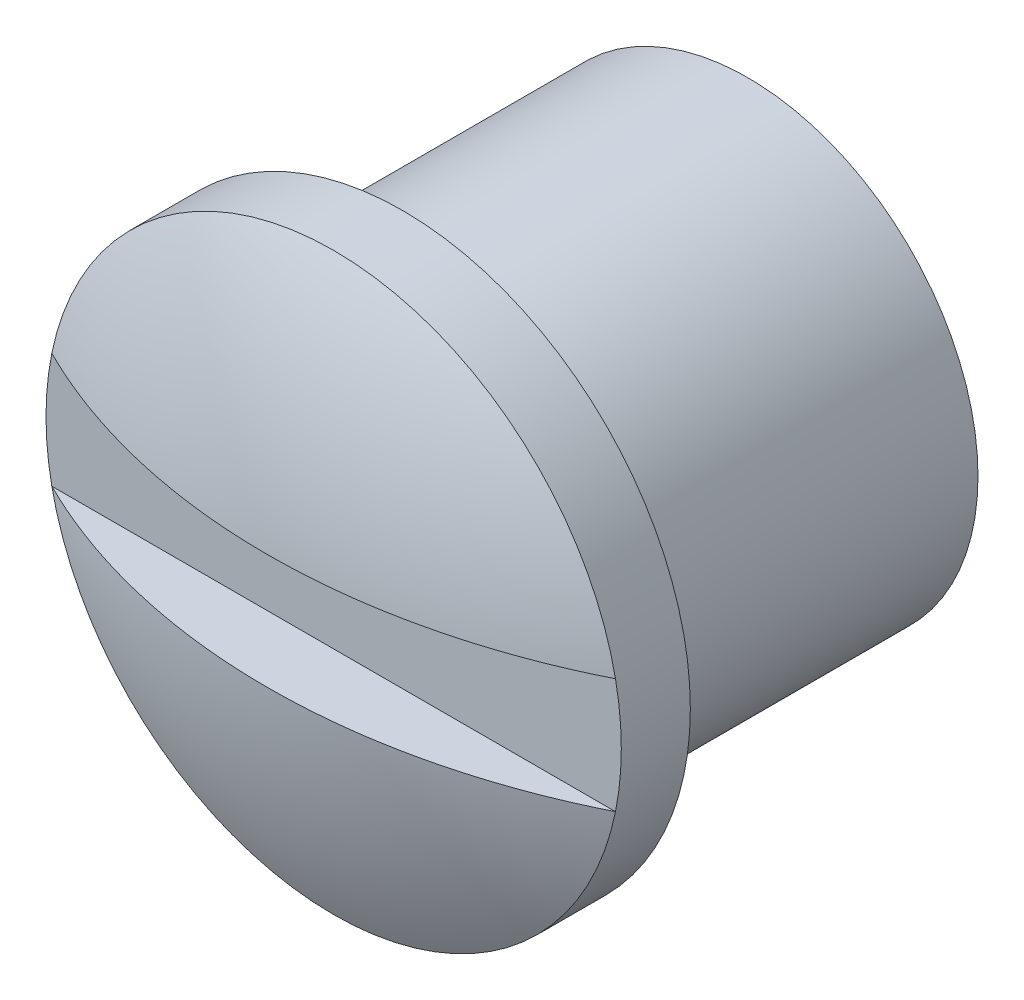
ISO-10303-21;
HEADER;
FILE_DESCRIPTION(('STEP AP214'),'2;1');
FILE_NAME('part.step','',(''),(''),'','','');
FILE_SCHEMA(('AUTOMOTIVE_DESIGN { 1 0 10303 214 1 1 1 1 }'));
ENDSEC;
DATA;
#1=APPLICATION_CONTEXT('core data for automotive mechanical design processes');
#2=APPLICATION_PROTOCOL_DEFINITION('international standard','automotive_design',2000,#1);
#3=PRODUCT_CONTEXT('',#1,'mechanical');
#4=PRODUCT('Part','Part','',(#3));
#5=PRODUCT_RELATED_PRODUCT_CATEGORY('part','',(#4));
#6=PRODUCT_DEFINITION_FORMATION('','',#4);
#7=PRODUCT_DEFINITION_CONTEXT('part definition',#1,'design');
#8=PRODUCT_DEFINITION('design','',#6,#7);
#9=PRODUCT_DEFINITION_SHAPE('','',#8);
#10=(LENGTH_UNIT() NAMED_UNIT(*) SI_UNIT(.MILLI.,.METRE.));
#11=(NAMED_UNIT(*) PLANE_ANGLE_UNIT() SI_UNIT($,.RADIAN.));
#12=(NAMED_UNIT(*) SI_UNIT($,.STERADIAN.) SOLID_ANGLE_UNIT());
#13=UNCERTAINTY_MEASURE_WITH_UNIT(LENGTH_MEASURE(1.E-05),#10,'distance_accuracy_value','');
#14=(GEOMETRIC_REPRESENTATION_CONTEXT(3) GLOBAL_UNCERTAINTY_ASSIGNED_CONTEXT((#13)) GLOBAL_UNIT_ASSIGNED_CONTEXT((#10,
#11,#12)) REPRESENTATION_CONTEXT('',''));
#15=CARTESIAN_POINT('',(0.,0.,0.));
#16=DIRECTION('',(0.,0.,1.));
#17=DIRECTION('',(1.,0.,0.));
#18=AXIS2_PLACEMENT_3D('',#15,#16,#17);
#19=CARTESIAN_POINT('',(0.,0.,-6.54166666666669));
#20=DIRECTION('',(0.,0.,-1.));
#21=DIRECTION('',(1.,0.,0.));
#22=AXIS2_PLACEMENT_3D('',#19,#20,#21);
#23=SPHERICAL_SURFACE('',#22,27.5416666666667);
#24=CARTESIAN_POINT('',(0.,-2.5,-6.54166666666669));
#25=DIRECTION('',(0.,1.,0.));
#26=DIRECTION('',(-1.,0.,0.));
#27=AXIS2_PLACEMENT_3D('',#24,#25,#26);
#28=CIRCLE('',#27,27.4279675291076);
#29=CARTESIAN_POINT('',(-12.2474487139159,-2.5,18.));
#30=VERTEX_POINT('',#29);
#31=CARTESIAN_POINT('',(12.2474487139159,-2.5,18.));
#32=VERTEX_POINT('',#31);
#33=EDGE_CURVE('E11',#30,#32,#28,.T.);
#34=ORIENTED_EDGE('',*,*,#33,.F.);
#35=CARTESIAN_POINT('',(0.,0.,18.));
#36=DIRECTION('',(0.,0.,1.));
#37=DIRECTION('',(1.,0.,0.));
#38=AXIS2_PLACEMENT_3D('',#35,#36,#37);
#39=CIRCLE('',#38,12.5);
#40=EDGE_CURVE('E73',#30,#32,#39,.T.);
#41=ORIENTED_EDGE('',*,*,#40,.T.);
#42=EDGE_LOOP('',(#34,#41));
#43=FACE_BOUND('',#42,.T.);
#44=ADVANCED_FACE('F39',(#43),#23,.T.);
#45=CARTESIAN_POINT('',(0.,2.5,-6.54166666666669));
#46=DIRECTION('',(0.,-1.,0.));
#47=DIRECTION('',(1.,0.,0.));
#48=AXIS2_PLACEMENT_3D('',#45,#46,#47);
#49=CIRCLE('',#48,27.4279675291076);
#50=CARTESIAN_POINT('',(12.2474487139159,2.5,18.));
#51=VERTEX_POINT('',#50);
#52=CARTESIAN_POINT('',(-12.2474487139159,2.5,18.));
#53=VERTEX_POINT('',#52);
#54=EDGE_CURVE('E47',#51,#53,#49,.T.);
#55=ORIENTED_EDGE('',*,*,#54,.F.);
#56=EDGE_CURVE('E72',#51,#53,#39,.T.);
#57=ORIENTED_EDGE('',*,*,#56,.T.);
#58=EDGE_LOOP('',(#55,#57));
#59=FACE_BOUND('',#58,.T.);
#60=ADVANCED_FACE('F97',(#59),#23,.T.);
#61=CARTESIAN_POINT('',(0.,0.,15.));
#62=DIRECTION('',(0.,0.,-1.));
#63=DIRECTION('',(-1.,0.,0.));
#64=AXIS2_PLACEMENT_3D('',#61,#62,#63);
#65=CYLINDRICAL_SURFACE('',#64,10.);
#66=CARTESIAN_POINT('',(0.,0.,15.));
#67=DIRECTION('',(0.,0.,1.));
#68=DIRECTION('',(1.,0.,0.));
#69=AXIS2_PLACEMENT_3D('',#66,#67,#68);
#70=CIRCLE('',#69,10.);
#71=CARTESIAN_POINT('',(10.,0.,15.));
#72=VERTEX_POINT('',#71);
#73=EDGE_CURVE('E89',#72,#72,#70,.T.);
#74=ORIENTED_EDGE('',*,*,#73,.F.);
#75=EDGE_LOOP('',(#74));
#76=FACE_BOUND('',#75,.T.);
#77=CARTESIAN_POINT('',(0.,0.,0.));
#78=DIRECTION('',(0.,0.,1.));
#79=DIRECTION('',(1.,0.,0.));
#80=AXIS2_PLACEMENT_3D('',#77,#78,#79);
#81=CIRCLE('',#80,10.);
#82=CARTESIAN_POINT('',(10.,0.,0.));
#83=VERTEX_POINT('',#82);
#84=EDGE_CURVE('E86',#83,#83,#81,.T.);
#85=ORIENTED_EDGE('',*,*,#84,.T.);
#86=EDGE_LOOP('',(#85));
#87=FACE_BOUND('',#86,.T.);
#88=ADVANCED_FACE('F41',(#76,#87),#65,.T.);
#89=CARTESIAN_POINT('',(0.,0.,0.));
#90=DIRECTION('',(0.,0.,1.));
#91=DIRECTION('',(1.,0.,0.));
#92=AXIS2_PLACEMENT_3D('',#89,#90,#91);
#93=PLANE('',#92);
#94=ORIENTED_EDGE('',*,*,#84,.F.);
#95=EDGE_LOOP('',(#94));
#96=FACE_BOUND('',#95,.T.);
#97=ADVANCED_FACE('F104',(#96),#93,.F.);
#98=CARTESIAN_POINT('',(0.,0.,18.));
#99=DIRECTION('',(0.,0.,-1.));
#100=DIRECTION('',(-1.,0.,0.));
#101=AXIS2_PLACEMENT_3D('',#98,#99,#100);
#102=CYLINDRICAL_SURFACE('',#101,12.5);
#103=ORIENTED_EDGE('',*,*,#56,.F.);
#104=EDGE_CURVE('E58',#32,#51,#39,.T.);
#105=ORIENTED_EDGE('',*,*,#104,.F.);
#106=ORIENTED_EDGE('',*,*,#40,.F.);
#107=EDGE_CURVE('E65',#53,#30,#39,.T.);
#108=ORIENTED_EDGE('',*,*,#107,.F.);
#109=EDGE_LOOP('',(#103,#105,#106,#108));
#110=FACE_BOUND('',#109,.T.);
#111=CARTESIAN_POINT('',(0.,0.,15.));
#112=DIRECTION('',(0.,0.,1.));
#113=DIRECTION('',(1.,0.,0.));
#114=AXIS2_PLACEMENT_3D('',#111,#112,#113);
#115=CIRCLE('',#114,12.5);
#116=CARTESIAN_POINT('',(12.5,0.,15.));
#117=VERTEX_POINT('',#116);
#118=EDGE_CURVE('E83',#117,#117,#115,.T.);
#119=ORIENTED_EDGE('',*,*,#118,.T.);
#120=EDGE_LOOP('',(#119));
#121=FACE_BOUND('',#120,.T.);
#122=ADVANCED_FACE('F81',(#110,#121),#102,.T.);
#123=CARTESIAN_POINT('',(0.,0.,15.));
#124=DIRECTION('',(0.,0.,1.));
#125=DIRECTION('',(1.,0.,0.));
#126=AXIS2_PLACEMENT_3D('',#123,#124,#125);
#127=PLANE('',#126);
#128=ORIENTED_EDGE('',*,*,#73,.T.);
#129=EDGE_LOOP('',(#128));
#130=FACE_BOUND('',#129,.T.);
#131=ORIENTED_EDGE('',*,*,#118,.F.);
#132=EDGE_LOOP('',(#131));
#133=FACE_BOUND('',#132,.T.);
#134=ADVANCED_FACE('F109',(#130,#133),#127,.F.);
#135=CARTESIAN_POINT('',(-37.5,-2.5,18.));
#136=DIRECTION('',(0.,1.,0.));
#137=DIRECTION('',(-1.,0.,0.));
#138=AXIS2_PLACEMENT_3D('',#135,#136,#137);
#139=PLANE('',#138);
#140=ORIENTED_EDGE('',*,*,#33,.T.);
#141=DIRECTION('',(-1.,0.,0.));
#142=VECTOR('',#141,1.);
#143=CARTESIAN_POINT('',(-37.5,-2.5,18.));
#144=LINE('',#143,#142);
#145=EDGE_CURVE('E54',#32,#30,#144,.T.);
#146=ORIENTED_EDGE('',*,*,#145,.T.);
#147=EDGE_LOOP('',(#140,#146));
#148=FACE_BOUND('',#147,.T.);
#149=ADVANCED_FACE('F77',(#148),#139,.T.);
#150=CARTESIAN_POINT('',(-37.5,2.5,18.));
#151=DIRECTION('',(0.,-1.,0.));
#152=DIRECTION('',(1.,0.,0.));
#153=AXIS2_PLACEMENT_3D('',#150,#151,#152);
#154=PLANE('',#153);
#155=ORIENTED_EDGE('',*,*,#54,.T.);
#156=DIRECTION('',(1.,0.,0.));
#157=VECTOR('',#156,1.);
#158=CARTESIAN_POINT('',(-37.5,2.5,18.));
#159=LINE('',#158,#157);
#160=EDGE_CURVE('E67',#53,#51,#159,.T.);
#161=ORIENTED_EDGE('',*,*,#160,.T.);
#162=EDGE_LOOP('',(#155,#161));
#163=FACE_BOUND('',#162,.T.);
#164=ADVANCED_FACE('F95',(#163),#154,.T.);
#165=CARTESIAN_POINT('',(0.,0.,18.));
#166=DIRECTION('',(0.,0.,1.));
#167=DIRECTION('',(1.,0.,0.));
#168=AXIS2_PLACEMENT_3D('',#165,#166,#167);
#169=PLANE('',#168);
#170=ORIENTED_EDGE('',*,*,#107,.T.);
#171=ORIENTED_EDGE('',*,*,#145,.F.);
#172=ORIENTED_EDGE('',*,*,#104,.T.);
#173=ORIENTED_EDGE('',*,*,#160,.F.);
#174=EDGE_LOOP('',(#170,#171,#172,#173));
#175=FACE_BOUND('',#174,.T.);
#176=ADVANCED_FACE('F66',(#175),#169,.T.);
#177=CLOSED_SHELL('',(#44,#60,#88,#97,#122,#134,#149,#164,#176));
#178=MANIFOLD_SOLID_BREP('B2',#177);
#179=ADVANCED_BREP_SHAPE_REPRESENTATION('',(#18,#178),#14);
#180=SHAPE_DEFINITION_REPRESENTATION(#9,#179);
ENDSEC;
END-ISO-10303-21;
